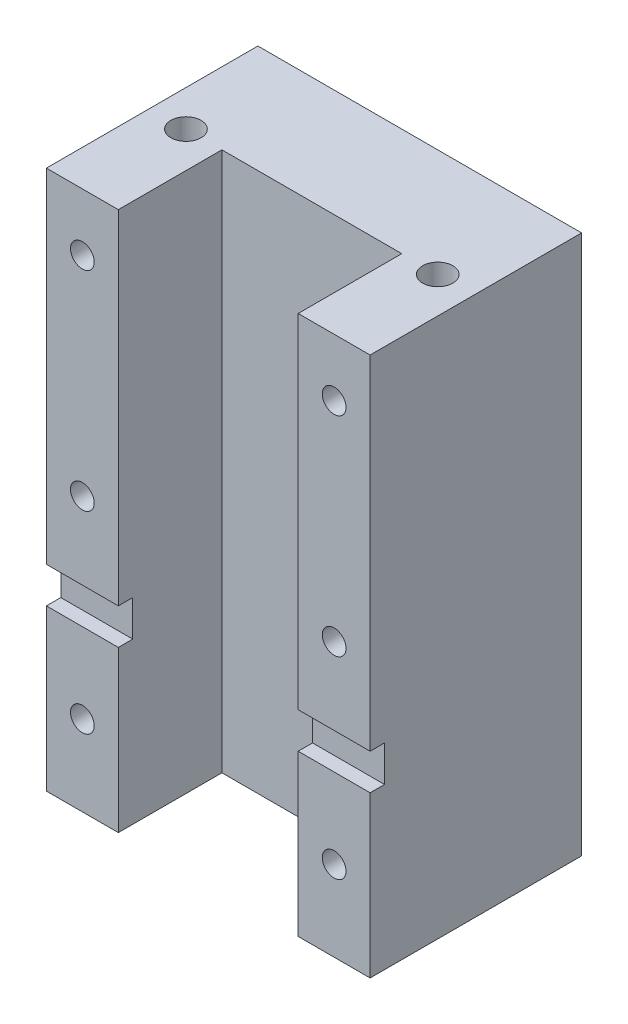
from build123d import *

# Parameters (mm, degrees)
SKETCH_1_W               = 45
SKETCH_1_H               = 75
EXTRUDE_1_DEPTH          = 29.4
CUT_EXTRUDE_1_DEPTH      = 93.273289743
CUT_EXTRUDE_1_DEPTH_BACK = 93.273289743
SKETCH_2_W               = 2
SKETCH_2_H               = 5
CUT_EXTRUDE_2_DEPTH      = 93.273289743
CUT_EXTRUDE_2_DEPTH_BACK = 93.273289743
SKETCH_3_W               = 25
SKETCH_3_H               = 14.4
SKETCH_4_R               = 2.1
CUT_EXTRUDE_3_DEPTH      = 93.273289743
SKETCH_7_R               = 1.65
CUT_EXTRUDE_4_DEPTH      = 12


with BuildPart() as part:
    # Sketch 1 → Extrude 1 (new body)
    with BuildSketch(Plane.XY):
        with Locations((22.5, 37.5)):
            Rectangle(SKETCH_1_W, SKETCH_1_H)
    extrude(amount=EXTRUDE_1_DEPTH)

    # Sketch 2 → Cut-Extrude 1 (cut, two sides: drawn at the far end of the back side and taken through both)
    with BuildSketch(Plane(origin=(45, 0, 0), x_dir=(0, 0, -1), z_dir=(1, 0, 0)).offset(-CUT_EXTRUDE_1_DEPTH_BACK)):
        with Locations((-28.4, 24.800000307)):
            Rectangle(SKETCH_2_W, SKETCH_2_H)
    extrude(amount=CUT_EXTRUDE_1_DEPTH + CUT_EXTRUDE_1_DEPTH_BACK, mode=Mode.SUBTRACT)

    # Sketch 3 → Cut-Extrude 2 (cut, two sides: drawn at the far end of the back side and taken through both)
    with BuildSketch(Plane(origin=(0, 75, 0), x_dir=(1, 0, 0), z_dir=(0, 1, 0)).offset(-CUT_EXTRUDE_2_DEPTH_BACK)):
        with Locations((22.5, -22.2)):
            Rectangle(SKETCH_3_W, SKETCH_3_H)
    extrude(amount=CUT_EXTRUDE_2_DEPTH + CUT_EXTRUDE_2_DEPTH_BACK, mode=Mode.SUBTRACT)

    # Sketch 4 → Cut-Extrude 3 (cut, through all)
    with BuildSketch(Plane(origin=(0, 75, 0), x_dir=(1, 0, 0), z_dir=(0, 1, 0))):
        with Locations(Location((5, -15, 0), (0, 0, 270))):
            Circle(SKETCH_4_R)
        with Locations(Location((40, -15, 0), (0, 0, 270))):
            Circle(SKETCH_4_R)
    extrude(amount=-CUT_EXTRUDE_3_DEPTH, mode=Mode.SUBTRACT)

    # Sketch 7 → Cut-Extrude 4 (cut)
    with BuildSketch(Plane.XY.offset(29.4)):
        with Locations((5, 11.180000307)):
            Circle(SKETCH_7_R)
        with Locations((40, 11.180000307)):
            Circle(SKETCH_7_R)
        with Locations((5, 67)):
            Circle(SKETCH_7_R)
        with Locations((40, 67)):
            Circle(SKETCH_7_R)
        with Locations((40, 38)):
            Circle(SKETCH_7_R)
        with Locations((5, 38)):
            Circle(SKETCH_7_R)
    extrude(amount=-CUT_EXTRUDE_4_DEPTH, mode=Mode.SUBTRACT)


solid = part.part
